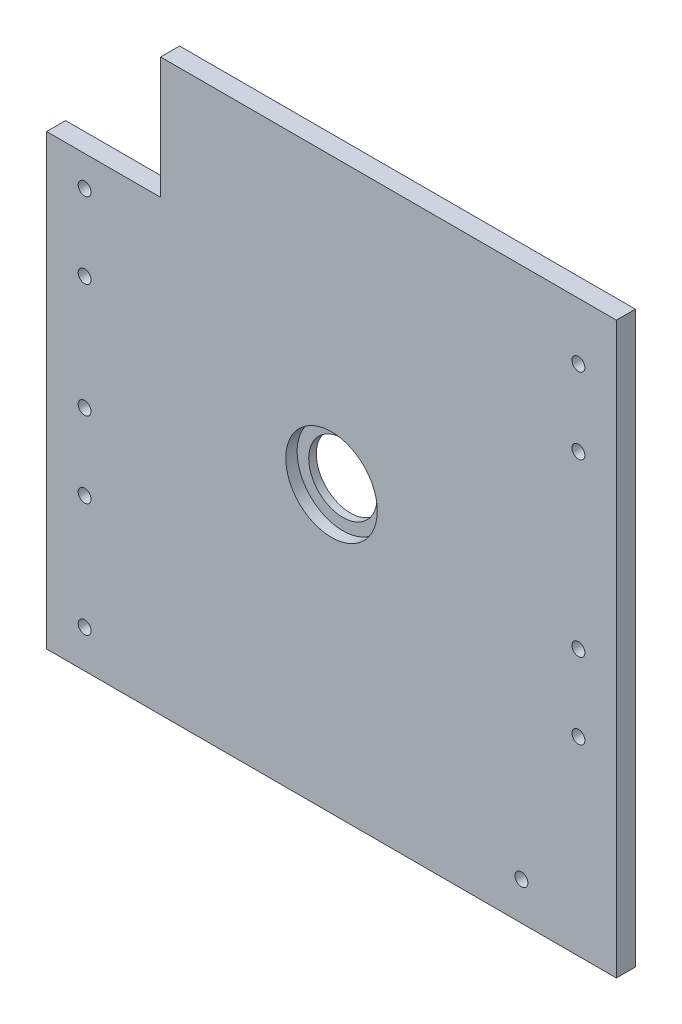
from build123d import *

# Parameters (mm, degrees)
SKETCH_1_W                   = 150
SKETCH_1_H                   = 150
EXTRUDE_1_DEPTH              = 5
HOLE_WIZARD_M3_1_D           = 3.4
HOLE_WIZARD_M3_1_DEPTH       = 11.5
HOLE_WIZARD_M3_1_CSINK_D     = 6.6
HOLE_WIZARD_M3_1_CSINK_ANGLE = 90
HOLE_WIZARD_M3_1_TIP         = 1.021463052
SKETCH_4_R                   = 9
CUT_EXTRUDE_1_DEPTH          = 5
SKETCH_5_R                   = 12.05
CUT_EXTRUDE_2_DEPTH          = 3
SKETCH_6_W                   = 30
SKETCH_6_H                   = 32
CUT_EXTRUDE_3_DEPTH          = 107.183802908


with BuildPart() as part:
    # Sketch 1 → Extrude 1 (new body)
    with BuildSketch(Plane.XY):
        Rectangle(SKETCH_1_W, SKETCH_1_H)
    extrude(amount=EXTRUDE_1_DEPTH)

    # Hole Wizard M3 _1
    with Locations(Plane(origin=(0, 0, 0), x_dir=(-1, 0, 0), z_dir=(0, 0, -1))):
        with Locations((65, 35), (65, 15), (65, -15), (65, -35), (65, -65), (-65, 60), (-65, 40), (-65, -5), (-65, -25), (-50, -65)):
            CounterSinkHole(HOLE_WIZARD_M3_1_D / 2, HOLE_WIZARD_M3_1_CSINK_D / 2, depth=HOLE_WIZARD_M3_1_DEPTH, counter_sink_angle=HOLE_WIZARD_M3_1_CSINK_ANGLE)
            with Locations((0, 0, -(HOLE_WIZARD_M3_1_DEPTH + HOLE_WIZARD_M3_1_TIP / 2))):  # 118° drill point
                Cone(0, HOLE_WIZARD_M3_1_D / 2, HOLE_WIZARD_M3_1_TIP, mode=Mode.SUBTRACT)

    # Sketch 4 → Cut-Extrude 1 (cut)
    with BuildSketch(Plane(origin=(0, 0, 0), x_dir=(-1, 0, 0), z_dir=(0, 0, -1))):
        Circle(SKETCH_4_R)
    extrude(amount=-CUT_EXTRUDE_1_DEPTH, mode=Mode.SUBTRACT)

    # Sketch 5 → Cut-Extrude 2 (cut)
    with BuildSketch(Plane.XY.offset(5)):
        Circle(SKETCH_5_R)
    extrude(amount=-CUT_EXTRUDE_2_DEPTH, mode=Mode.SUBTRACT)

    # Sketch 6 → Cut-Extrude 3 (cut, through all)
    with BuildSketch(Plane(origin=(0, 0, 0), x_dir=(-1, 0, 0), z_dir=(0, 0, -1))):
        with Locations((60, 59)):
            Rectangle(SKETCH_6_W, SKETCH_6_H)
    extrude(amount=-CUT_EXTRUDE_3_DEPTH, mode=Mode.SUBTRACT)


solid = part.part
